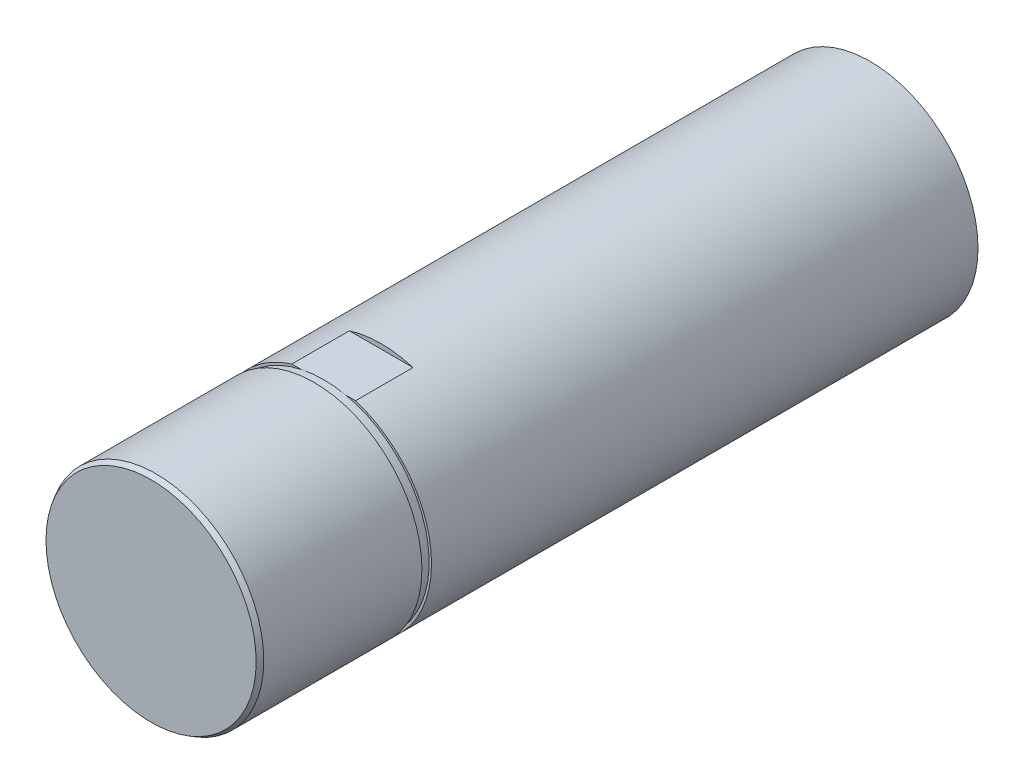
from build123d import *

# Parameters (mm, degrees)
SKETCH1_R        = 22.5
STROKE_DEPTH     = 100
EXTRUDE_START    = 14
SKETCH2_R        = 22.5
EXTRUDE_L2_DEPTH = 14
EXTRUDE_START_2  = 36
SKETCH3_R        = 22.5
EXTRUDE_L3_DEPTH = 36
CHAMFER2_SIZE    = 1
CHAMFER2_SIZE2   = 0.577350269
U_C_START        = 2
SKETCH5_R        = 22.5
SKETCH5_R_2      = 22
U_C_DEPTH        = 2
SKETCH6_W        = 12
SKETCH6_H        = 1.5
A_F_DEPTH        = 10.5


with BuildPart() as part:
    # Sketch1 → STROKE (new body)
    with BuildSketch(Plane.XY):
        Circle(SKETCH1_R)
    extrude(amount=-STROKE_DEPTH)

    # Sketch2 → Extrude L2 (add)
    with BuildSketch(Plane.XY.offset(EXTRUDE_START)):
        Circle(SKETCH2_R)
    extrude(amount=-EXTRUDE_L2_DEPTH)

    # Sketch3 → Extrude L3 (add)
    with BuildSketch(Plane.XY.offset(14).offset(EXTRUDE_START_2)):
        Circle(SKETCH3_R)
    extrude(amount=-EXTRUDE_L3_DEPTH)

    # Chamfer2
    chamfer2_edges = [part.edges().sort_by_distance(p)[0] for p in [
        (-22.5, 0, 50),
    ]]
    chamfer2_side = [part.faces().sort_by_distance(p)[0] for p in [
        (-22.5, 0, -25),
    ]]
    chamfer(chamfer2_edges, length=CHAMFER2_SIZE, length2=CHAMFER2_SIZE2, reference=chamfer2_side[0])

    # Sketch5 → U_C (cut)
    with BuildSketch(Plane.XY.offset(14).offset(U_C_START)):
        Circle(SKETCH5_R)
        Circle(SKETCH5_R_2, mode=Mode.SUBTRACT)
    extrude(amount=-U_C_DEPTH, mode=Mode.SUBTRACT)

    # Sketch6 → A_F (cut, symmetric)
    with BuildSketch(Plane(origin=(0, 0, 0), x_dir=(0, 0, -1), z_dir=(1, 0, 0))):
        with Locations((-8, 22.25)):
            Rectangle(SKETCH6_W, SKETCH6_H)
        with Locations((-8, -22.25)):
            Rectangle(SKETCH6_W, SKETCH6_H)
    extrude(amount=A_F_DEPTH, both=True, mode=Mode.SUBTRACT)


solid = part.part
